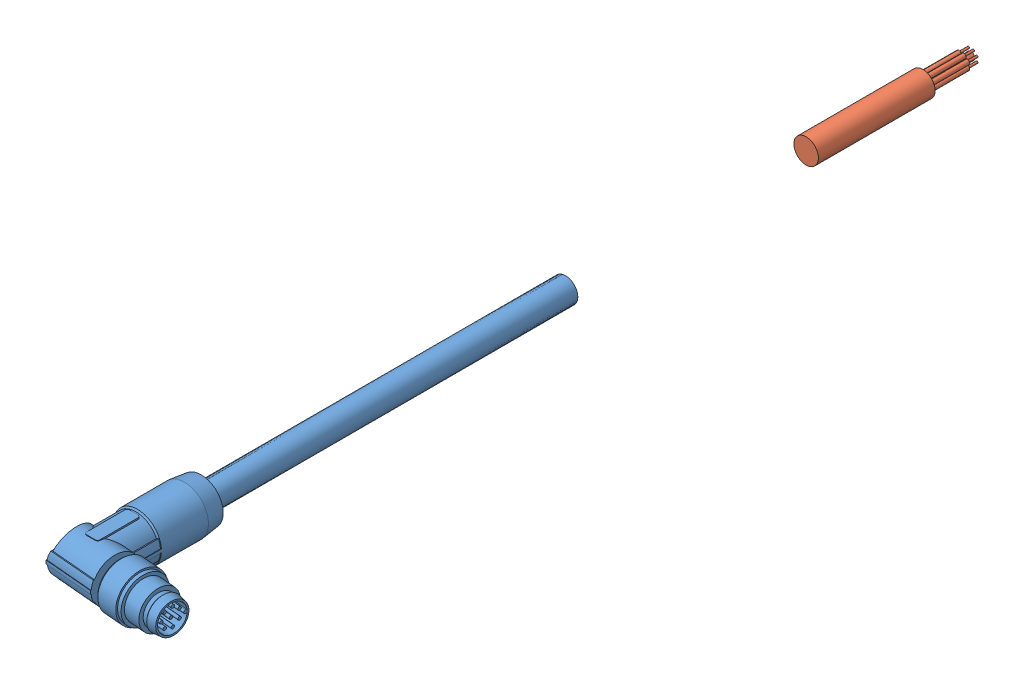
SolidWorks assembly IMR-I_O-C-5.sldasm, configuration Default (file format 15000). Lengths in mm.
Overall size (23.56 10 188.66).
2 component instances, 2 part files, 0 mates.
Components (placement in the parent):
- IMR-I_O-C-5_01-1: IMR-I_O-C-5_01.SLDPRT [ﾃﾞﾌｫﾙﾄ] at origin size (23.56 10 104.4)
- IMR-I_O-C-5_02-1: IMR-I_O-C-5_02.SLDPRT [ﾃﾞﾌｫﾙﾄ] at origin size (5.1 5.1 34.27)
